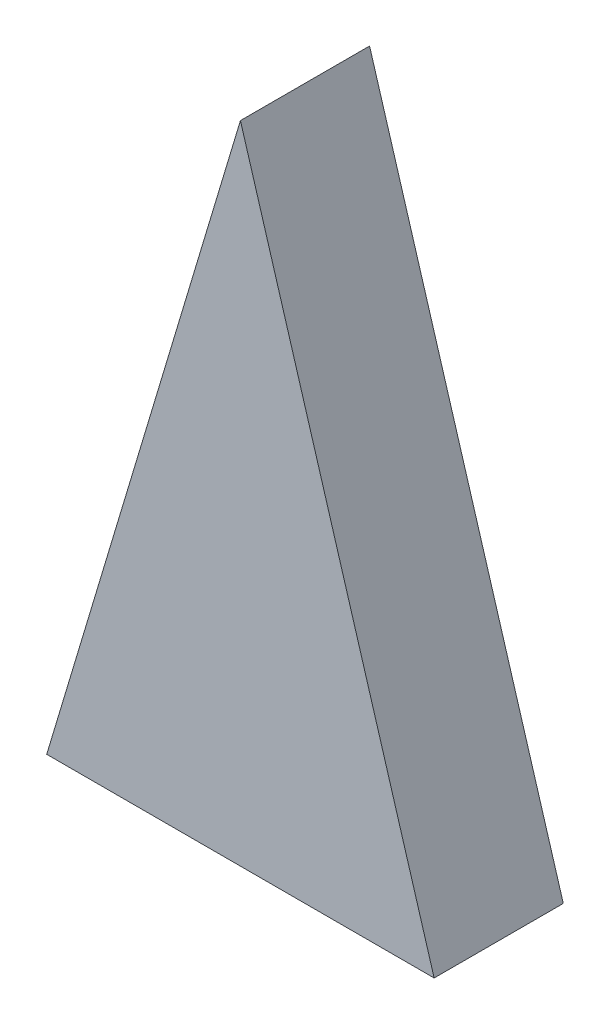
from build123d import *

# Parameters (mm, degrees)
BOSS_EXTRUDE1_DEPTH = 5


with BuildPart() as part:
    # Sketch1 → Boss-Extrude1 (new body)
    with BuildSketch(Plane.XY):
        Polygon((0, 0), (7.5, 25), (15, 0), align=None)
    extrude(amount=BOSS_EXTRUDE1_DEPTH)


solid = part.part
